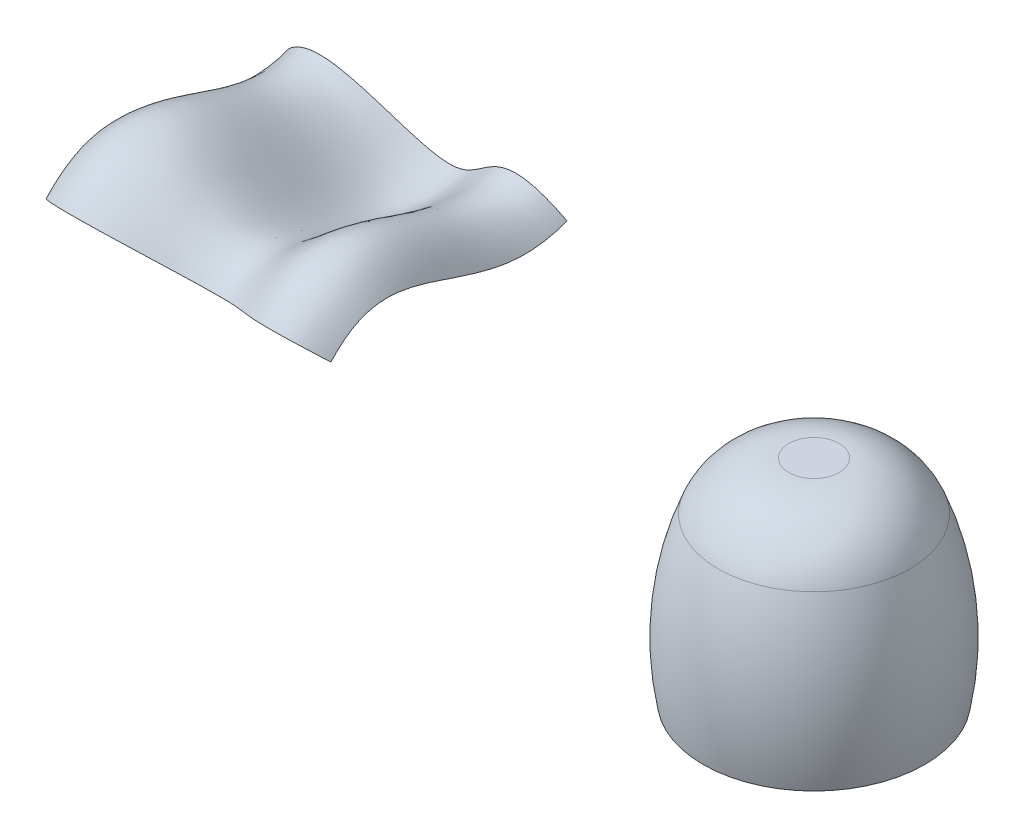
ISO-10303-21;
HEADER;
FILE_DESCRIPTION(('STEP AP214'),'2;1');
FILE_NAME('part.step','',(''),(''),'','','');
FILE_SCHEMA(('AUTOMOTIVE_DESIGN { 1 0 10303 214 1 1 1 1 }'));
ENDSEC;
DATA;
#1=APPLICATION_CONTEXT('core data for automotive mechanical design processes');
#2=APPLICATION_PROTOCOL_DEFINITION('international standard','automotive_design',2000,#1);
#3=PRODUCT_CONTEXT('',#1,'mechanical');
#4=PRODUCT('Part','Part','',(#3));
#5=PRODUCT_RELATED_PRODUCT_CATEGORY('part','',(#4));
#6=PRODUCT_DEFINITION_FORMATION('','',#4);
#7=PRODUCT_DEFINITION_CONTEXT('part definition',#1,'design');
#8=PRODUCT_DEFINITION('design','',#6,#7);
#9=PRODUCT_DEFINITION_SHAPE('','',#8);
#10=(LENGTH_UNIT() NAMED_UNIT(*) SI_UNIT(.MILLI.,.METRE.));
#11=(NAMED_UNIT(*) PLANE_ANGLE_UNIT() SI_UNIT($,.RADIAN.));
#12=(NAMED_UNIT(*) SI_UNIT($,.STERADIAN.) SOLID_ANGLE_UNIT());
#13=UNCERTAINTY_MEASURE_WITH_UNIT(LENGTH_MEASURE(1.E-05),#10,'distance_accuracy_value','');
#14=(GEOMETRIC_REPRESENTATION_CONTEXT(3) GLOBAL_UNCERTAINTY_ASSIGNED_CONTEXT((#13)) GLOBAL_UNIT_ASSIGNED_CONTEXT((#10,
#11,#12)) REPRESENTATION_CONTEXT('',''));
#15=CARTESIAN_POINT('',(0.,0.,0.));
#16=DIRECTION('',(0.,0.,1.));
#17=DIRECTION('',(1.,0.,0.));
#18=AXIS2_PLACEMENT_3D('',#15,#16,#17);
#19=CARTESIAN_POINT('',(385.5240094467,64.9627120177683,0.));
#20=DIRECTION('',(0.,-1.,0.));
#21=DIRECTION('',(1.,0.,0.));
#22=AXIS2_PLACEMENT_3D('',#19,#20,#21);
#23=PLANE('',#22);
#24=CARTESIAN_POINT('',(385.5240094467,64.9627120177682,0.));
#25=DIRECTION('',(0.,1.,0.));
#26=DIRECTION('',(-1.,0.,0.));
#27=AXIS2_PLACEMENT_3D('',#24,#25,#26);
#28=CIRCLE('',#27,19.5882363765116);
#29=CARTESIAN_POINT('',(365.935773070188,64.962712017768,0.));
#30=VERTEX_POINT('',#29);
#31=EDGE_CURVE('E12',#30,#30,#28,.T.);
#32=ORIENTED_EDGE('',*,*,#31,.T.);
#33=EDGE_LOOP('',(#32));
#34=FACE_BOUND('',#33,.T.);
#35=ADVANCED_FACE('F57',(#34),#23,.F.);
#36=CARTESIAN_POINT('',(385.524009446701,5.88824763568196,0.));
#37=DIRECTION('',(0.,1.,0.));
#38=DIRECTION('',(-1.,0.,0.));
#39=AXIS2_PLACEMENT_3D('',#36,#37,#38);
#40=DEGENERATE_TOROIDAL_SURFACE('',#39,19.588236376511,59.0744643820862,.T.);
#41=ORIENTED_EDGE('',*,*,#31,.F.);
#42=EDGE_LOOP('',(#41));
#43=FACE_BOUND('',#42,.T.);
#44=CARTESIAN_POINT('',(385.5240094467,27.4883624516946,0.));
#45=DIRECTION('',(0.,1.,0.));
#46=DIRECTION('',(-1.,0.,0.));
#47=AXIS2_PLACEMENT_3D('',#44,#45,#46);
#48=CIRCLE('',#47,74.5721193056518);
#49=CARTESIAN_POINT('',(310.951890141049,27.4883624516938,0.));
#50=VERTEX_POINT('',#49);
#51=EDGE_CURVE('E63',#50,#50,#48,.T.);
#52=ORIENTED_EDGE('',*,*,#51,.T.);
#53=EDGE_LOOP('',(#52));
#54=FACE_BOUND('',#53,.T.);
#55=ADVANCED_FACE('F82',(#43,#54),#40,.T.);
#56=CARTESIAN_POINT('',(385.524009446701,-55.6869145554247,0.));
#57=DIRECTION('',(0.,1.,0.));
#58=DIRECTION('',(-1.,0.,0.));
#59=AXIS2_PLACEMENT_3D('',#56,#57,#58);
#60=DEGENERATE_TOROIDAL_SURFACE('',#59,137.153592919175,227.477260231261,.F.);
#61=ORIENTED_EDGE('',*,*,#51,.F.);
#62=EDGE_LOOP('',(#61));
#63=FACE_BOUND('',#62,.T.);
#64=CARTESIAN_POINT('',(385.524009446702,-98.5118003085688,0.));
#65=DIRECTION('',(0.,1.,0.));
#66=DIRECTION('',(-1.,0.,0.));
#67=AXIS2_PLACEMENT_3D('',#64,#65,#66);
#68=CIRCLE('',#67,86.2561944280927);
#69=CARTESIAN_POINT('',(299.267815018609,-98.5118003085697,0.));
#70=VERTEX_POINT('',#69);
#71=EDGE_CURVE('E67',#70,#70,#68,.T.);
#72=ORIENTED_EDGE('',*,*,#71,.T.);
#73=EDGE_LOOP('',(#72));
#74=FACE_BOUND('',#73,.T.);
#75=ADVANCED_FACE('F74',(#63,#74),#60,.F.);
#76=CARTESIAN_POINT('',(385.524009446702,-98.5118003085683,0.));
#77=DIRECTION('',(0.,1.,0.));
#78=DIRECTION('',(-1.,0.,0.));
#79=AXIS2_PLACEMENT_3D('',#76,#77,#78);
#80=PLANE('',#79);
#81=ORIENTED_EDGE('',*,*,#71,.F.);
#82=EDGE_LOOP('',(#81));
#83=FACE_BOUND('',#82,.T.);
#84=ADVANCED_FACE('F76',(#83),#80,.F.);
#85=CLOSED_SHELL('',(#35,#55,#75,#84));
#86=MANIFOLD_SOLID_BREP('B2',#85);
#87=CARTESIAN_POINT('',(82.5622898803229,17.8526118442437,-110.772308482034));
#88=CARTESIAN_POINT('',(82.5622898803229,14.2223393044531,-101.742491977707));
#89=CARTESIAN_POINT('',(82.5622898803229,10.2565746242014,-81.6616708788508));
#90=CARTESIAN_POINT('',(82.5622898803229,13.5918390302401,-54.8245615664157));
#91=CARTESIAN_POINT('',(82.5622898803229,21.0838368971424,-29.5499528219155));
#92=CARTESIAN_POINT('',(82.5622898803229,29.4488965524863,-6.00108285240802));
#93=CARTESIAN_POINT('',(82.5622898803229,35.5218162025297,15.9002199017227));
#94=CARTESIAN_POINT('',(82.5622898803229,36.52976756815,31.6283903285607));
#95=CARTESIAN_POINT('',(82.5622898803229,34.5780878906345,42.7095882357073));
#96=CARTESIAN_POINT('',(82.5622898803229,32.1159450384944,50.0023862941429));
#97=CARTESIAN_POINT('',(82.5622898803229,28.2011165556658,57.4275321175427));
#98=CARTESIAN_POINT('',(82.5622898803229,22.7293385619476,64.9287791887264));
#99=CARTESIAN_POINT('',(82.5622898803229,17.3082090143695,70.4752184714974));
#100=CARTESIAN_POINT('',(82.5622898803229,14.5893591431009,72.9415967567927));
#101=CARTESIAN_POINT('',(44.4296231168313,67.8508660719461,-90.6714250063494));
#102=CARTESIAN_POINT('',(44.4296231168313,63.9349438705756,-80.9310932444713));
#103=CARTESIAN_POINT('',(44.4296231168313,66.2786647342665,-83.7425928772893));
#104=CARTESIAN_POINT('',(44.4296231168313,66.0215228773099,-66.0575337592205));
#105=CARTESIAN_POINT('',(44.4296231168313,72.0864070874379,-47.4445777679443));
#106=CARTESIAN_POINT('',(44.4296231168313,80.4464122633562,-23.2973009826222));
#107=CARTESIAN_POINT('',(44.4296231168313,88.6774689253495,5.08187311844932));
#108=CARTESIAN_POINT('',(44.4296231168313,91.0077758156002,33.0739876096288));
#109=CARTESIAN_POINT('',(44.4296231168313,86.9921465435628,56.0911182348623));
#110=CARTESIAN_POINT('',(44.4296231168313,81.8439242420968,71.4339259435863));
#111=CARTESIAN_POINT('',(44.4296231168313,73.6619585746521,86.6044446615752));
#112=CARTESIAN_POINT('',(44.4296231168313,64.5352865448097,99.4285431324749));
#113=CARTESIAN_POINT('',(44.4296231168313,53.3036927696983,110.578546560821));
#114=CARTESIAN_POINT('',(44.4296231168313,50.795419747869,112.853902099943));
#115=CARTESIAN_POINT('',(-12.4672058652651,-59.8593432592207,-142.014978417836));
#116=CARTESIAN_POINT('',(-12.4672058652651,-64.4198142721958,-130.671417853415));
#117=CARTESIAN_POINT('',(-12.4672058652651,-76.1804408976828,-80.013639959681));
#118=CARTESIAN_POINT('',(-12.4672058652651,-68.0701154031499,-36.9402039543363));
#119=CARTESIAN_POINT('',(-12.4672058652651,-58.1434900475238,-1.8502171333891));
#120=CARTESIAN_POINT('',(-12.4672058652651,-49.8278788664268,20.9123358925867));
#121=CARTESIAN_POINT('',(-12.4672058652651,-47.0965929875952,32.7087795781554));
#122=CARTESIAN_POINT('',(-12.4672058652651,-48.1389080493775,29.3764658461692));
#123=CARTESIAN_POINT('',(-12.4672058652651,-46.8974483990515,21.9185829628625));
#124=CARTESIAN_POINT('',(-12.4672058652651,-45.1422573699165,16.6609693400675));
#125=CARTESIAN_POINT('',(-12.4672058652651,-42.5843205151,12.1923000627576));
#126=CARTESIAN_POINT('',(-12.4672058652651,-41.7792285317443,10.8795429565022));
#127=CARTESIAN_POINT('',(-12.4672058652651,-39.6523599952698,9.06183929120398));
#128=CARTESIAN_POINT('',(-12.4672058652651,-41.6854808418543,10.9061651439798));
#129=CARTESIAN_POINT('',(-84.4595235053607,74.2000501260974,-88.1188517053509));
#130=CARTESIAN_POINT('',(-84.4595235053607,70.6138459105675,-79.1986492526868));
#131=CARTESIAN_POINT('',(-84.4595235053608,73.2229500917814,-83.5843501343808));
#132=CARTESIAN_POINT('',(-84.4595235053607,72.7249713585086,-67.597186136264));
#133=CARTESIAN_POINT('',(-84.4595235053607,78.5509745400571,-49.6866839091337));
#134=CARTESIAN_POINT('',(-84.4595235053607,86.9256000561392,-25.5017108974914));
#135=CARTESIAN_POINT('',(-84.4595235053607,95.4273202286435,3.70975622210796));
#136=CARTESIAN_POINT('',(-84.4595235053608,97.9242023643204,33.2589042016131));
#137=CARTESIAN_POINT('',(-84.4595235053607,93.6504294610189,57.7883312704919));
#138=CARTESIAN_POINT('',(-84.4595235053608,88.1498201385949,74.1636044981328));
#139=CARTESIAN_POINT('',(-84.4595235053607,79.4684905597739,90.2791370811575));
#140=CARTESIAN_POINT('',(-84.4595235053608,69.7189300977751,103.923190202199));
#141=CARTESIAN_POINT('',(-84.4595235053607,58.1444961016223,115.426441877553));
#142=CARTESIAN_POINT('',(-84.4595235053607,55.3931591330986,117.922290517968));
#143=CARTESIAN_POINT('',(-128.886832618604,30.6776115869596,-105.616251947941));
#144=CARTESIAN_POINT('',(-128.886832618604,27.6339008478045,-98.0454293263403));
#145=CARTESIAN_POINT('',(-128.886832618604,24.320518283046,-81.433745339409));
#146=CARTESIAN_POINT('',(-128.886832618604,27.1225556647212,-57.9100006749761));
#147=CARTESIAN_POINT('',(-128.886832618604,34.1445428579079,-34.0854601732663));
#148=CARTESIAN_POINT('',(-128.886832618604,42.5358216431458,-10.4521329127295));
#149=CARTESIAN_POINT('',(-128.886832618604,49.156203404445,13.1282541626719));
#150=CARTESIAN_POINT('',(-128.886832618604,50.5009201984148,32.0016200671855));
#151=CARTESIAN_POINT('',(-128.886832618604,48.0269464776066,46.1383164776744));
#152=CARTESIAN_POINT('',(-128.886832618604,44.8554515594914,55.5144212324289));
#153=CARTESIAN_POINT('',(-128.886832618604,39.9227071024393,64.8568125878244));
#154=CARTESIAN_POINT('',(-128.886832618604,33.2271930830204,73.9830592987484));
#155=CARTESIAN_POINT('',(-128.886832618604,27.0277934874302,80.3208292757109));
#156=CARTESIAN_POINT('',(-128.886832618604,23.8765377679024,83.179460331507));
#157=B_SPLINE_SURFACE_WITH_KNOTS('',3,3,((#87,#88,#89,#90,#91,#92,#93,#94,#95,#96,#97,#98,#99,
#100),(#101,#102,#103,#104,#105,#106,#107,#108,#109,#110,#111,#112,#113,#114),(#115,#116,#117,
#118,#119,#120,#121,#122,#123,#124,#125,#126,#127,#128),(#129,#130,#131,#132,#133,#134,#135,
#136,#137,#138,#139,#140,#141,#142),(#143,#144,#145,#146,#147,#148,#149,#150,#151,#152,#153,
#154,#155,#156)),.UNSPECIFIED.,.F.,.F.,.F.,(4,1,4),(4,1,1,1,1,1,1,1,1,1,1,4),(0.,
0.443177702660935,1.),(0.,0.125,0.25,0.375000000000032,0.5,0.625,0.75,0.8,0.85,0.9,
0.950000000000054,1.),.UNSPECIFIED.);
#158=CARTESIAN_POINT('',(82.5622898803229,17.8526118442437,-110.772308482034));
#159=CARTESIAN_POINT('',(44.4296231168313,67.8508660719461,-90.6714250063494));
#160=CARTESIAN_POINT('',(-12.4672058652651,-59.8593432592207,-142.014978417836));
#161=CARTESIAN_POINT('',(-84.4595235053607,74.2000501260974,-88.1188517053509));
#162=CARTESIAN_POINT('',(-128.886832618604,30.6776115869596,-105.616251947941));
#163=B_SPLINE_CURVE_WITH_KNOTS('',3,(#158,#159,#160,#161,#162),.UNSPECIFIED.,.F.,.F.,(4,1,4),
(0.,0.443177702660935,1.),.UNSPECIFIED.);
#164=CARTESIAN_POINT('',(82.5622898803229,17.8526118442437,-110.772308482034));
#165=VERTEX_POINT('',#164);
#166=CARTESIAN_POINT('',(-128.886832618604,30.6776115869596,-105.616251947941));
#167=VERTEX_POINT('',#166);
#168=EDGE_CURVE('E55',#165,#167,#163,.T.);
#169=CARTESIAN_POINT('',(-128.886832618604,30.6776115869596,-105.616251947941));
#170=CARTESIAN_POINT('',(-128.886832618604,27.6339008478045,-98.0454293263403));
#171=CARTESIAN_POINT('',(-128.886832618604,24.320518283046,-81.433745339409));
#172=CARTESIAN_POINT('',(-128.886832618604,27.1225556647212,-57.9100006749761));
#173=CARTESIAN_POINT('',(-128.886832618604,34.1445428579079,-34.0854601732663));
#174=CARTESIAN_POINT('',(-128.886832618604,42.5358216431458,-10.4521329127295));
#175=CARTESIAN_POINT('',(-128.886832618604,49.156203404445,13.1282541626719));
#176=CARTESIAN_POINT('',(-128.886832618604,50.5009201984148,32.0016200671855));
#177=CARTESIAN_POINT('',(-128.886832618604,48.0269464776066,46.1383164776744));
#178=CARTESIAN_POINT('',(-128.886832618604,44.8554515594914,55.5144212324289));
#179=CARTESIAN_POINT('',(-128.886832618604,39.9227071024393,64.8568125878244));
#180=CARTESIAN_POINT('',(-128.886832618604,33.2271930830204,73.9830592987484));
#181=CARTESIAN_POINT('',(-128.886832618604,27.0277934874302,80.3208292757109));
#182=CARTESIAN_POINT('',(-128.886832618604,23.8765377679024,83.179460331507));
#183=B_SPLINE_CURVE_WITH_KNOTS('',3,(#169,#170,#171,#172,#173,#174,#175,#176,#177,#178,#179,
#180,#181,#182),.UNSPECIFIED.,.F.,.F.,(4,1,1,1,1,1,1,1,1,1,1,4),(0.,0.125,0.25,
0.375000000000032,0.5,0.625,0.75,0.8,0.85,0.9,0.950000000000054,1.),.UNSPECIFIED.);
#184=CARTESIAN_POINT('',(-128.886832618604,23.8765377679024,83.179460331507));
#185=VERTEX_POINT('',#184);
#186=EDGE_CURVE('E123',#167,#185,#183,.T.);
#187=CARTESIAN_POINT('',(82.5622898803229,14.5893591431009,72.9415967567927));
#188=CARTESIAN_POINT('',(44.4296231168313,50.795419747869,112.853902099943));
#189=CARTESIAN_POINT('',(-12.4672058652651,-41.6854808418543,10.9061651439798));
#190=CARTESIAN_POINT('',(-84.4595235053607,55.3931591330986,117.922290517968));
#191=CARTESIAN_POINT('',(-128.886832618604,23.8765377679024,83.179460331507));
#192=B_SPLINE_CURVE_WITH_KNOTS('',3,(#187,#188,#189,#190,#191),.UNSPECIFIED.,.F.,.F.,(4,1,4),
(0.,0.443177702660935,1.),.UNSPECIFIED.);
#193=CARTESIAN_POINT('',(82.5622898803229,14.5893591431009,72.9415967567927));
#194=VERTEX_POINT('',#193);
#195=EDGE_CURVE('E131',#185,#194,#192,.F.);
#196=CARTESIAN_POINT('',(82.5622898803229,17.8526118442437,-110.772308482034));
#197=CARTESIAN_POINT('',(82.5622898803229,14.2223393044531,-101.742491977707));
#198=CARTESIAN_POINT('',(82.5622898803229,10.2565746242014,-81.6616708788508));
#199=CARTESIAN_POINT('',(82.5622898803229,13.5918390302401,-54.8245615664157));
#200=CARTESIAN_POINT('',(82.5622898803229,21.0838368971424,-29.5499528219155));
#201=CARTESIAN_POINT('',(82.5622898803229,29.4488965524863,-6.00108285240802));
#202=CARTESIAN_POINT('',(82.5622898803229,35.5218162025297,15.9002199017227));
#203=CARTESIAN_POINT('',(82.5622898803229,36.52976756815,31.6283903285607));
#204=CARTESIAN_POINT('',(82.5622898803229,34.5780878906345,42.7095882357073));
#205=CARTESIAN_POINT('',(82.5622898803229,32.1159450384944,50.0023862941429));
#206=CARTESIAN_POINT('',(82.5622898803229,28.2011165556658,57.4275321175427));
#207=CARTESIAN_POINT('',(82.5622898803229,22.7293385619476,64.9287791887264));
#208=CARTESIAN_POINT('',(82.5622898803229,17.3082090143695,70.4752184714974));
#209=CARTESIAN_POINT('',(82.5622898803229,14.5893591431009,72.9415967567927));
#210=B_SPLINE_CURVE_WITH_KNOTS('',3,(#196,#197,#198,#199,#200,#201,#202,#203,#204,#205,#206,
#207,#208,#209),.UNSPECIFIED.,.F.,.F.,(4,1,1,1,1,1,1,1,1,1,1,4),(0.,0.125,0.25,
0.375000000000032,0.5,0.625,0.75,0.8,0.85,0.9,0.950000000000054,1.),.UNSPECIFIED.);
#211=EDGE_CURVE('E115',#194,#165,#210,.F.);
#212=ORIENTED_EDGE('',*,*,#168,.T.);
#213=ORIENTED_EDGE('',*,*,#186,.T.);
#214=ORIENTED_EDGE('',*,*,#195,.T.);
#215=ORIENTED_EDGE('',*,*,#211,.T.);
#216=EDGE_LOOP('',(#212,#213,#214,#215));
#217=FACE_BOUND('',#216,.T.);
#218=ADVANCED_FACE('F112',(#217),#157,.T.);
#219=OPEN_SHELL('',(#218));
#220=SHELL_BASED_SURFACE_MODEL('B7',(#219));
#221=ADVANCED_BREP_SHAPE_REPRESENTATION('',(#18,#86),#14);
#222=MANIFOLD_SURFACE_SHAPE_REPRESENTATION('',(#18,#220),#14);
#223=SHAPE_REPRESENTATION('',(#18),#14);
#224=SHAPE_DEFINITION_REPRESENTATION(#9,#223);
#225=SHAPE_REPRESENTATION_RELATIONSHIP('','',#223,#221);
#226=SHAPE_REPRESENTATION_RELATIONSHIP('','',#223,#222);
ENDSEC;
END-ISO-10303-21;
